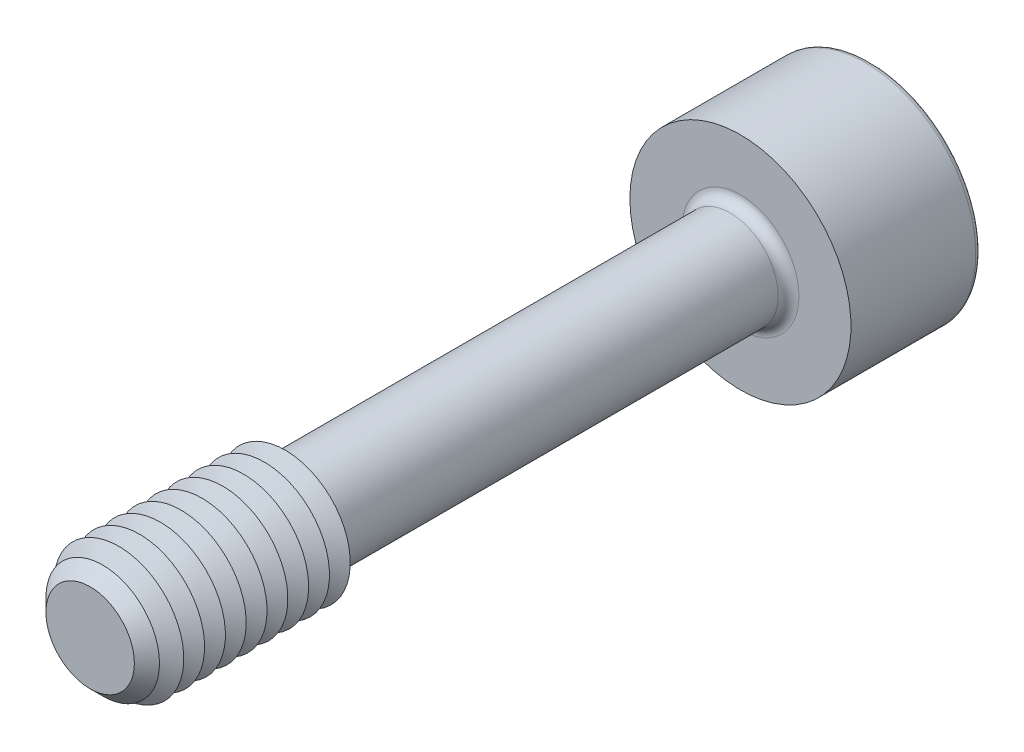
ISO-10303-21;
HEADER;
FILE_DESCRIPTION(('STEP AP214'),'2;1');
FILE_NAME('part.step','',(''),(''),'','','');
FILE_SCHEMA(('AUTOMOTIVE_DESIGN { 1 0 10303 214 1 1 1 1 }'));
ENDSEC;
DATA;
#1=APPLICATION_CONTEXT('core data for automotive mechanical design processes');
#2=APPLICATION_PROTOCOL_DEFINITION('international standard','automotive_design',2000,#1);
#3=PRODUCT_CONTEXT('',#1,'mechanical');
#4=PRODUCT('Part','Part','',(#3));
#5=PRODUCT_RELATED_PRODUCT_CATEGORY('part','',(#4));
#6=PRODUCT_DEFINITION_FORMATION('','',#4);
#7=PRODUCT_DEFINITION_CONTEXT('part definition',#1,'design');
#8=PRODUCT_DEFINITION('design','',#6,#7);
#9=PRODUCT_DEFINITION_SHAPE('','',#8);
#10=(LENGTH_UNIT() NAMED_UNIT(*) SI_UNIT(.MILLI.,.METRE.));
#11=(NAMED_UNIT(*) PLANE_ANGLE_UNIT() SI_UNIT($,.RADIAN.));
#12=(NAMED_UNIT(*) SI_UNIT($,.STERADIAN.) SOLID_ANGLE_UNIT());
#13=UNCERTAINTY_MEASURE_WITH_UNIT(LENGTH_MEASURE(1.E-05),#10,'distance_accuracy_value','');
#14=(GEOMETRIC_REPRESENTATION_CONTEXT(3) GLOBAL_UNCERTAINTY_ASSIGNED_CONTEXT((#13)) GLOBAL_UNIT_ASSIGNED_CONTEXT((#10,
#11,#12)) REPRESENTATION_CONTEXT('',''));
#15=CARTESIAN_POINT('',(0.,0.,0.));
#16=DIRECTION('',(0.,0.,1.));
#17=DIRECTION('',(1.,0.,0.));
#18=AXIS2_PLACEMENT_3D('',#15,#16,#17);
#19=CARTESIAN_POINT('',(-1.15470053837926,-2.,-13.5));
#20=DIRECTION('',(0.,0.,1.));
#21=DIRECTION('',(1.,0.,0.));
#22=AXIS2_PLACEMENT_3D('',#19,#20,#21);
#23=PLANE('',#22);
#24=DIRECTION('',(1.,0.,0.));
#25=VECTOR('',#24,1.);
#26=CARTESIAN_POINT('',(-1.15470053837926,-2.,-13.5));
#27=LINE('',#26,#25);
#28=CARTESIAN_POINT('',(0.,-2.,-13.5));
#29=VERTEX_POINT('',#28);
#30=CARTESIAN_POINT('',(1.15470053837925,-2.,-13.5));
#31=VERTEX_POINT('',#30);
#32=EDGE_CURVE('E795',#29,#31,#27,.T.);
#33=ORIENTED_EDGE('',*,*,#32,.F.);
#34=CARTESIAN_POINT('',(0.,0.,-13.5));
#35=DIRECTION('',(0.,0.,1.));
#36=DIRECTION('',(0.,-1.,0.));
#37=AXIS2_PLACEMENT_3D('',#34,#35,#36);
#38=CIRCLE('',#37,2.);
#39=CARTESIAN_POINT('',(1.73205080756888,-0.999999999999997,-13.5));
#40=VERTEX_POINT('',#39);
#41=EDGE_CURVE('E53',#29,#40,#38,.T.);
#42=ORIENTED_EDGE('',*,*,#41,.T.);
#43=DIRECTION('',(0.5,0.866025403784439,0.));
#44=VECTOR('',#43,1.);
#45=CARTESIAN_POINT('',(1.15470053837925,-2.,-13.5));
#46=LINE('',#45,#44);
#47=EDGE_CURVE('E782',#31,#40,#46,.T.);
#48=ORIENTED_EDGE('',*,*,#47,.F.);
#49=EDGE_LOOP('',(#33,#42,#48));
#50=FACE_BOUND('',#49,.T.);
#51=ADVANCED_FACE('F41',(#50),#23,.F.);
#52=CARTESIAN_POINT('',(2.3094010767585,0.,-13.5));
#53=VERTEX_POINT('',#52);
#54=EDGE_CURVE('E791',#40,#53,#46,.T.);
#55=ORIENTED_EDGE('',*,*,#54,.F.);
#56=CARTESIAN_POINT('',(1.73205080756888,1.,-13.5));
#57=VERTEX_POINT('',#56);
#58=EDGE_CURVE('E11',#40,#57,#38,.T.);
#59=ORIENTED_EDGE('',*,*,#58,.T.);
#60=DIRECTION('',(-0.499999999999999,0.866025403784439,0.));
#61=VECTOR('',#60,1.);
#62=CARTESIAN_POINT('',(2.3094010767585,0.,-13.5));
#63=LINE('',#62,#61);
#64=EDGE_CURVE('E781',#53,#57,#63,.T.);
#65=ORIENTED_EDGE('',*,*,#64,.F.);
#66=EDGE_LOOP('',(#55,#59,#65));
#67=FACE_BOUND('',#66,.T.);
#68=ADVANCED_FACE('F133',(#67),#23,.F.);
#69=CARTESIAN_POINT('',(1.15470053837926,2.,-13.5));
#70=VERTEX_POINT('',#69);
#71=EDGE_CURVE('E776',#57,#70,#63,.T.);
#72=ORIENTED_EDGE('',*,*,#71,.F.);
#73=CARTESIAN_POINT('',(0.,2.00000000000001,-13.5));
#74=VERTEX_POINT('',#73);
#75=EDGE_CURVE('E51',#57,#74,#38,.T.);
#76=ORIENTED_EDGE('',*,*,#75,.T.);
#77=DIRECTION('',(-1.,0.,0.));
#78=VECTOR('',#77,1.);
#79=CARTESIAN_POINT('',(1.15470053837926,2.,-13.5));
#80=LINE('',#79,#78);
#81=EDGE_CURVE('E177',#70,#74,#80,.T.);
#82=ORIENTED_EDGE('',*,*,#81,.F.);
#83=EDGE_LOOP('',(#72,#76,#82));
#84=FACE_BOUND('',#83,.T.);
#85=ADVANCED_FACE('F139',(#84),#23,.F.);
#86=CARTESIAN_POINT('',(-1.15470053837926,2.,-13.5));
#87=VERTEX_POINT('',#86);
#88=EDGE_CURVE('E786',#74,#87,#80,.T.);
#89=ORIENTED_EDGE('',*,*,#88,.F.);
#90=CARTESIAN_POINT('',(-1.73205080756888,1.00000000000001,-13.5));
#91=VERTEX_POINT('',#90);
#92=EDGE_CURVE('E264',#74,#91,#38,.T.);
#93=ORIENTED_EDGE('',*,*,#92,.T.);
#94=DIRECTION('',(-0.5,-0.866025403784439,0.));
#95=VECTOR('',#94,1.);
#96=CARTESIAN_POINT('',(-1.15470053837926,2.,-13.5));
#97=LINE('',#96,#95);
#98=EDGE_CURVE('E176',#87,#91,#97,.T.);
#99=ORIENTED_EDGE('',*,*,#98,.F.);
#100=EDGE_LOOP('',(#89,#93,#99));
#101=FACE_BOUND('',#100,.T.);
#102=ADVANCED_FACE('F157',(#101),#23,.F.);
#103=CARTESIAN_POINT('',(-2.30940107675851,0.,-13.5));
#104=VERTEX_POINT('',#103);
#105=EDGE_CURVE('E170',#91,#104,#97,.T.);
#106=ORIENTED_EDGE('',*,*,#105,.F.);
#107=CARTESIAN_POINT('',(-1.73205080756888,-0.999999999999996,-13.5));
#108=VERTEX_POINT('',#107);
#109=EDGE_CURVE('E172',#91,#108,#38,.T.);
#110=ORIENTED_EDGE('',*,*,#109,.T.);
#111=DIRECTION('',(0.5,-0.866025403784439,0.));
#112=VECTOR('',#111,1.);
#113=CARTESIAN_POINT('',(-2.30940107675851,0.,-13.5));
#114=LINE('',#113,#112);
#115=EDGE_CURVE('E174',#104,#108,#114,.T.);
#116=ORIENTED_EDGE('',*,*,#115,.F.);
#117=EDGE_LOOP('',(#106,#110,#116));
#118=FACE_BOUND('',#117,.T.);
#119=ADVANCED_FACE('F146',(#118),#23,.F.);
#120=CARTESIAN_POINT('',(0.,0.,-17.5));
#121=DIRECTION('',(0.,0.,-1.));
#122=DIRECTION('',(-1.,0.,0.));
#123=AXIS2_PLACEMENT_3D('',#120,#121,#122);
#124=PLANE('',#123);
#125=CARTESIAN_POINT('',(0.,0.,-17.5));
#126=DIRECTION('',(0.,0.,-1.));
#127=DIRECTION('',(-1.,0.,0.));
#128=AXIS2_PLACEMENT_3D('',#125,#126,#127);
#129=CIRCLE('',#128,4.05);
#130=CARTESIAN_POINT('',(-4.05,0.,-17.5));
#131=VERTEX_POINT('',#130);
#132=EDGE_CURVE('E250',#131,#131,#129,.T.);
#133=ORIENTED_EDGE('',*,*,#132,.T.);
#134=EDGE_LOOP('',(#133));
#135=FACE_BOUND('',#134,.T.);
#136=DIRECTION('',(-0.5,-0.866025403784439,0.));
#137=VECTOR('',#136,1.);
#138=CARTESIAN_POINT('',(-1.15470053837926,2.,-17.5));
#139=LINE('',#138,#137);
#140=CARTESIAN_POINT('',(-1.15470053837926,2.,-17.5));
#141=VERTEX_POINT('',#140);
#142=CARTESIAN_POINT('',(-2.30940107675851,0.,-17.5));
#143=VERTEX_POINT('',#142);
#144=EDGE_CURVE('E211',#141,#143,#139,.T.);
#145=ORIENTED_EDGE('',*,*,#144,.T.);
#146=DIRECTION('',(0.5,-0.866025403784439,0.));
#147=VECTOR('',#146,1.);
#148=CARTESIAN_POINT('',(-2.30940107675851,0.,-17.5));
#149=LINE('',#148,#147);
#150=CARTESIAN_POINT('',(-1.15470053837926,-2.,-17.5));
#151=VERTEX_POINT('',#150);
#152=EDGE_CURVE('E67',#143,#151,#149,.T.);
#153=ORIENTED_EDGE('',*,*,#152,.T.);
#154=DIRECTION('',(1.,0.,0.));
#155=VECTOR('',#154,1.);
#156=CARTESIAN_POINT('',(-1.15470053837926,-2.,-17.5));
#157=LINE('',#156,#155);
#158=CARTESIAN_POINT('',(1.15470053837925,-2.,-17.5));
#159=VERTEX_POINT('',#158);
#160=EDGE_CURVE('E196',#151,#159,#157,.T.);
#161=ORIENTED_EDGE('',*,*,#160,.T.);
#162=DIRECTION('',(0.5,0.866025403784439,0.));
#163=VECTOR('',#162,1.);
#164=CARTESIAN_POINT('',(1.15470053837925,-2.,-17.5));
#165=LINE('',#164,#163);
#166=CARTESIAN_POINT('',(2.3094010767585,0.,-17.5));
#167=VERTEX_POINT('',#166);
#168=EDGE_CURVE('E200',#159,#167,#165,.T.);
#169=ORIENTED_EDGE('',*,*,#168,.T.);
#170=DIRECTION('',(-0.499999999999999,0.866025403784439,0.));
#171=VECTOR('',#170,1.);
#172=CARTESIAN_POINT('',(2.3094010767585,0.,-17.5));
#173=LINE('',#172,#171);
#174=CARTESIAN_POINT('',(1.15470053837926,2.,-17.5));
#175=VERTEX_POINT('',#174);
#176=EDGE_CURVE('E204',#167,#175,#173,.T.);
#177=ORIENTED_EDGE('',*,*,#176,.T.);
#178=DIRECTION('',(-1.,0.,0.));
#179=VECTOR('',#178,1.);
#180=CARTESIAN_POINT('',(1.15470053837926,2.,-17.5));
#181=LINE('',#180,#179);
#182=EDGE_CURVE('E208',#175,#141,#181,.T.);
#183=ORIENTED_EDGE('',*,*,#182,.T.);
#184=EDGE_LOOP('',(#145,#153,#161,#169,#177,#183));
#185=FACE_BOUND('',#184,.T.);
#186=ADVANCED_FACE('F156',(#135,#185),#124,.T.);
#187=CARTESIAN_POINT('',(0.,0.,12.5));
#188=DIRECTION('',(0.,0.,-1.));
#189=DIRECTION('',(-1.,0.,0.));
#190=AXIS2_PLACEMENT_3D('',#187,#188,#189);
#191=CYLINDRICAL_SURFACE('',#190,1.85);
#192=CARTESIAN_POINT('',(0.,0.,-12.1));
#193=DIRECTION('',(0.,0.,-1.));
#194=DIRECTION('',(-1.,0.,0.));
#195=AXIS2_PLACEMENT_3D('',#192,#193,#194);
#196=CIRCLE('',#195,1.85);
#197=CARTESIAN_POINT('',(-1.85,0.,-12.1));
#198=VERTEX_POINT('',#197);
#199=EDGE_CURVE('E246',#198,#198,#196,.F.);
#200=ORIENTED_EDGE('',*,*,#199,.T.);
#201=EDGE_LOOP('',(#200));
#202=FACE_BOUND('',#201,.T.);
#203=CARTESIAN_POINT('',(0.,0.,4.62472232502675));
#204=DIRECTION('',(0.,0.,-1.));
#205=DIRECTION('',(0.,1.,0.));
#206=AXIS2_PLACEMENT_3D('',#203,#204,#205);
#207=CIRCLE('',#206,1.85);
#208=CARTESIAN_POINT('',(0.,1.85,4.62472232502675));
#209=VERTEX_POINT('',#208);
#210=EDGE_CURVE('E234',#209,#209,#207,.T.);
#211=ORIENTED_EDGE('',*,*,#210,.T.);
#212=EDGE_LOOP('',(#211));
#213=FACE_BOUND('',#212,.T.);
#214=ADVANCED_FACE('F163',(#202,#213),#191,.T.);
#215=CARTESIAN_POINT('',(0.,0.,4.62472232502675));
#216=DIRECTION('',(0.,0.,1.));
#217=DIRECTION('',(0.,-1.,0.));
#218=AXIS2_PLACEMENT_3D('',#215,#216,#217);
#219=CONICAL_SURFACE('',#218,1.85,1.0471975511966);
#220=CARTESIAN_POINT('',(0.,0.,5.));
#221=DIRECTION('',(0.,0.,-1.));
#222=DIRECTION('',(-1.,0.,0.));
#223=AXIS2_PLACEMENT_3D('',#220,#221,#222);
#224=CIRCLE('',#223,2.5);
#225=CARTESIAN_POINT('',(-2.5,0.,5.));
#226=VERTEX_POINT('',#225);
#227=EDGE_CURVE('E267',#226,#226,#224,.T.);
#228=ORIENTED_EDGE('',*,*,#227,.T.);
#229=EDGE_LOOP('',(#228));
#230=FACE_BOUND('',#229,.T.);
#231=ORIENTED_EDGE('',*,*,#210,.F.);
#232=EDGE_LOOP('',(#231));
#233=FACE_BOUND('',#232,.T.);
#234=ADVANCED_FACE('F537',(#230,#233),#219,.T.);
#235=CARTESIAN_POINT('',(0.,0.,-12.5));
#236=DIRECTION('',(0.,0.,-1.));
#237=DIRECTION('',(-1.,0.,0.));
#238=AXIS2_PLACEMENT_3D('',#235,#236,#237);
#239=PLANE('',#238);
#240=CARTESIAN_POINT('',(0.,0.,-12.5));
#241=DIRECTION('',(0.,0.,-1.));
#242=DIRECTION('',(-1.,0.,0.));
#243=AXIS2_PLACEMENT_3D('',#240,#241,#242);
#244=CIRCLE('',#243,2.25);
#245=CARTESIAN_POINT('',(-2.25,0.,-12.5));
#246=VERTEX_POINT('',#245);
#247=EDGE_CURVE('E242',#246,#246,#244,.T.);
#248=ORIENTED_EDGE('',*,*,#247,.T.);
#249=EDGE_LOOP('',(#248));
#250=FACE_BOUND('',#249,.T.);
#251=CARTESIAN_POINT('',(0.,0.,-12.5));
#252=DIRECTION('',(0.,0.,-1.));
#253=DIRECTION('',(-1.,0.,0.));
#254=AXIS2_PLACEMENT_3D('',#251,#252,#253);
#255=CIRCLE('',#254,4.25);
#256=CARTESIAN_POINT('',(-4.25,0.,-12.5));
#257=VERTEX_POINT('',#256);
#258=EDGE_CURVE('E230',#257,#257,#255,.T.);
#259=ORIENTED_EDGE('',*,*,#258,.F.);
#260=EDGE_LOOP('',(#259));
#261=FACE_BOUND('',#260,.T.);
#262=ADVANCED_FACE('F530',(#250,#261),#239,.F.);
#263=CARTESIAN_POINT('',(0.,0.,-17.5));
#264=DIRECTION('',(0.,0.,1.));
#265=DIRECTION('',(1.,0.,0.));
#266=AXIS2_PLACEMENT_3D('',#263,#264,#265);
#267=CYLINDRICAL_SURFACE('',#266,4.25);
#268=CARTESIAN_POINT('',(0.,0.,-17.3));
#269=DIRECTION('',(0.,0.,-1.));
#270=DIRECTION('',(-1.,0.,0.));
#271=AXIS2_PLACEMENT_3D('',#268,#269,#270);
#272=CIRCLE('',#271,4.25);
#273=CARTESIAN_POINT('',(-4.25,0.,-17.3));
#274=VERTEX_POINT('',#273);
#275=EDGE_CURVE('E253',#274,#274,#272,.F.);
#276=ORIENTED_EDGE('',*,*,#275,.T.);
#277=EDGE_LOOP('',(#276));
#278=FACE_BOUND('',#277,.T.);
#279=ORIENTED_EDGE('',*,*,#258,.T.);
#280=EDGE_LOOP('',(#279));
#281=FACE_BOUND('',#280,.T.);
#282=ADVANCED_FACE('F536',(#278,#281),#267,.T.);
#283=CARTESIAN_POINT('',(-2.30940107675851,0.,-13.5));
#284=DIRECTION('',(0.866025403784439,0.5,0.));
#285=DIRECTION('',(-0.5,0.866025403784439,0.));
#286=AXIS2_PLACEMENT_3D('',#283,#284,#285);
#287=PLANE('',#286);
#288=ORIENTED_EDGE('',*,*,#152,.F.);
#289=DIRECTION('',(0.,0.,-1.));
#290=VECTOR('',#289,1.);
#291=CARTESIAN_POINT('',(-2.30940107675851,0.,-13.5));
#292=LINE('',#291,#290);
#293=EDGE_CURVE('E186',#104,#143,#292,.T.);
#294=ORIENTED_EDGE('',*,*,#293,.F.);
#295=ORIENTED_EDGE('',*,*,#115,.T.);
#296=CARTESIAN_POINT('',(-1.15470053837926,-2.,-13.5));
#297=VERTEX_POINT('',#296);
#298=EDGE_CURVE('E214',#108,#297,#114,.T.);
#299=ORIENTED_EDGE('',*,*,#298,.T.);
#300=DIRECTION('',(0.,0.,-1.));
#301=VECTOR('',#300,1.);
#302=CARTESIAN_POINT('',(-1.15470053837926,-2.,-13.5));
#303=LINE('',#302,#301);
#304=EDGE_CURVE('E227',#297,#151,#303,.T.);
#305=ORIENTED_EDGE('',*,*,#304,.T.);
#306=EDGE_LOOP('',(#288,#294,#295,#299,#305));
#307=FACE_BOUND('',#306,.T.);
#308=ADVANCED_FACE('F548',(#307),#287,.T.);
#309=CARTESIAN_POINT('',(-1.15470053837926,-2.,-13.5));
#310=DIRECTION('',(0.,1.,0.));
#311=DIRECTION('',(-1.,0.,0.));
#312=AXIS2_PLACEMENT_3D('',#309,#310,#311);
#313=PLANE('',#312);
#314=ORIENTED_EDGE('',*,*,#160,.F.);
#315=ORIENTED_EDGE('',*,*,#304,.F.);
#316=EDGE_CURVE('E792',#297,#29,#27,.T.);
#317=ORIENTED_EDGE('',*,*,#316,.T.);
#318=ORIENTED_EDGE('',*,*,#32,.T.);
#319=DIRECTION('',(0.,0.,-1.));
#320=VECTOR('',#319,1.);
#321=CARTESIAN_POINT('',(1.15470053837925,-2.,-13.5));
#322=LINE('',#321,#320);
#323=EDGE_CURVE('E224',#31,#159,#322,.T.);
#324=ORIENTED_EDGE('',*,*,#323,.T.);
#325=EDGE_LOOP('',(#314,#315,#317,#318,#324));
#326=FACE_BOUND('',#325,.T.);
#327=ADVANCED_FACE('F564',(#326),#313,.T.);
#328=CARTESIAN_POINT('',(1.15470053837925,-2.,-13.5));
#329=DIRECTION('',(-0.866025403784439,0.5,0.));
#330=DIRECTION('',(-0.5,-0.866025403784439,0.));
#331=AXIS2_PLACEMENT_3D('',#328,#329,#330);
#332=PLANE('',#331);
#333=ORIENTED_EDGE('',*,*,#168,.F.);
#334=ORIENTED_EDGE('',*,*,#323,.F.);
#335=ORIENTED_EDGE('',*,*,#47,.T.);
#336=ORIENTED_EDGE('',*,*,#54,.T.);
#337=DIRECTION('',(0.,0.,-1.));
#338=VECTOR('',#337,1.);
#339=CARTESIAN_POINT('',(2.3094010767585,0.,-13.5));
#340=LINE('',#339,#338);
#341=EDGE_CURVE('E221',#53,#167,#340,.T.);
#342=ORIENTED_EDGE('',*,*,#341,.T.);
#343=EDGE_LOOP('',(#333,#334,#335,#336,#342));
#344=FACE_BOUND('',#343,.T.);
#345=ADVANCED_FACE('F574',(#344),#332,.T.);
#346=CARTESIAN_POINT('',(2.3094010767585,0.,-13.5));
#347=DIRECTION('',(-0.866025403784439,-0.499999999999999,0.));
#348=DIRECTION('',(0.499999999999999,-0.866025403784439,0.));
#349=AXIS2_PLACEMENT_3D('',#346,#347,#348);
#350=PLANE('',#349);
#351=ORIENTED_EDGE('',*,*,#176,.F.);
#352=ORIENTED_EDGE('',*,*,#341,.F.);
#353=ORIENTED_EDGE('',*,*,#64,.T.);
#354=ORIENTED_EDGE('',*,*,#71,.T.);
#355=DIRECTION('',(0.,0.,-1.));
#356=VECTOR('',#355,1.);
#357=CARTESIAN_POINT('',(1.15470053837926,2.,-13.5));
#358=LINE('',#357,#356);
#359=EDGE_CURVE('E218',#70,#175,#358,.T.);
#360=ORIENTED_EDGE('',*,*,#359,.T.);
#361=EDGE_LOOP('',(#351,#352,#353,#354,#360));
#362=FACE_BOUND('',#361,.T.);
#363=ADVANCED_FACE('F584',(#362),#350,.T.);
#364=CARTESIAN_POINT('',(1.15470053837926,2.,-13.5));
#365=DIRECTION('',(0.,-1.,0.));
#366=DIRECTION('',(0.,0.,-1.));
#367=AXIS2_PLACEMENT_3D('',#364,#365,#366);
#368=PLANE('',#367);
#369=ORIENTED_EDGE('',*,*,#182,.F.);
#370=ORIENTED_EDGE('',*,*,#359,.F.);
#371=ORIENTED_EDGE('',*,*,#81,.T.);
#372=ORIENTED_EDGE('',*,*,#88,.T.);
#373=DIRECTION('',(0.,0.,-1.));
#374=VECTOR('',#373,1.);
#375=CARTESIAN_POINT('',(-1.15470053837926,2.,-13.5));
#376=LINE('',#375,#374);
#377=EDGE_CURVE('E182',#87,#141,#376,.T.);
#378=ORIENTED_EDGE('',*,*,#377,.T.);
#379=EDGE_LOOP('',(#369,#370,#371,#372,#378));
#380=FACE_BOUND('',#379,.T.);
#381=ADVANCED_FACE('F152',(#380),#368,.T.);
#382=CARTESIAN_POINT('',(-1.15470053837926,2.,-13.5));
#383=DIRECTION('',(0.866025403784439,-0.5,0.));
#384=DIRECTION('',(0.5,0.866025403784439,0.));
#385=AXIS2_PLACEMENT_3D('',#382,#383,#384);
#386=PLANE('',#385);
#387=ORIENTED_EDGE('',*,*,#144,.F.);
#388=ORIENTED_EDGE('',*,*,#377,.F.);
#389=ORIENTED_EDGE('',*,*,#98,.T.);
#390=ORIENTED_EDGE('',*,*,#105,.T.);
#391=ORIENTED_EDGE('',*,*,#293,.T.);
#392=EDGE_LOOP('',(#387,#388,#389,#390,#391));
#393=FACE_BOUND('',#392,.T.);
#394=ADVANCED_FACE('F144',(#393),#386,.T.);
#395=ORIENTED_EDGE('',*,*,#298,.F.);
#396=EDGE_CURVE('E256',#108,#29,#38,.T.);
#397=ORIENTED_EDGE('',*,*,#396,.T.);
#398=ORIENTED_EDGE('',*,*,#316,.F.);
#399=EDGE_LOOP('',(#395,#397,#398));
#400=FACE_BOUND('',#399,.T.);
#401=ADVANCED_FACE('F135',(#400),#23,.F.);
#402=CARTESIAN_POINT('',(0.,0.,-12.1));
#403=DIRECTION('',(0.,0.,-1.));
#404=DIRECTION('',(-1.,0.,0.));
#405=AXIS2_PLACEMENT_3D('',#402,#403,#404);
#406=TOROIDAL_SURFACE('',#405,2.25,0.4);
#407=ORIENTED_EDGE('',*,*,#199,.F.);
#408=EDGE_LOOP('',(#407));
#409=FACE_BOUND('',#408,.T.);
#410=ORIENTED_EDGE('',*,*,#247,.F.);
#411=EDGE_LOOP('',(#410));
#412=FACE_BOUND('',#411,.T.);
#413=ADVANCED_FACE('F129',(#409,#412),#406,.F.);
#414=CARTESIAN_POINT('',(0.,0.,-17.3));
#415=DIRECTION('',(0.,0.,-1.));
#416=DIRECTION('',(-1.,0.,0.));
#417=AXIS2_PLACEMENT_3D('',#414,#415,#416);
#418=TOROIDAL_SURFACE('',#417,4.05,0.2);
#419=ORIENTED_EDGE('',*,*,#275,.F.);
#420=EDGE_LOOP('',(#419));
#421=FACE_BOUND('',#420,.T.);
#422=ORIENTED_EDGE('',*,*,#132,.F.);
#423=EDGE_LOOP('',(#422));
#424=FACE_BOUND('',#423,.T.);
#425=ADVANCED_FACE('F43',(#421,#424),#418,.T.);
#426=CARTESIAN_POINT('',(0.,0.,-12.3452994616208));
#427=DIRECTION('',(0.,0.,-1.));
#428=DIRECTION('',(0.,1.,0.));
#429=AXIS2_PLACEMENT_3D('',#426,#427,#428);
#430=CONICAL_SURFACE('',#429,0.,1.04719755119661);
#431=ORIENTED_EDGE('',*,*,#41,.F.);
#432=ORIENTED_EDGE('',*,*,#396,.F.);
#433=ORIENTED_EDGE('',*,*,#109,.F.);
#434=ORIENTED_EDGE('',*,*,#92,.F.);
#435=ORIENTED_EDGE('',*,*,#75,.F.);
#436=ORIENTED_EDGE('',*,*,#58,.F.);
#437=EDGE_LOOP('',(#431,#432,#433,#434,#435,#436));
#438=FACE_BOUND('',#437,.T.);
#439=CARTESIAN_POINT('',(0.,0.,-12.3452994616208));
#440=VERTEX_POINT('',#439);
#441=VERTEX_LOOP('',#440);
#442=FACE_BOUND('',#441,.T.);
#443=ADVANCED_FACE('F118',(#438,#442),#430,.F.);
#444=CARTESIAN_POINT('',(0.,0.,5.4));
#445=DIRECTION('',(0.,0.,-1.));
#446=DIRECTION('',(-1.,0.,0.));
#447=AXIS2_PLACEMENT_3D('',#444,#445,#446);
#448=CONICAL_SURFACE('',#447,1.80717967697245,1.0471975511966);
#449=ORIENTED_EDGE('',*,*,#227,.F.);
#450=EDGE_LOOP('',(#449));
#451=FACE_BOUND('',#450,.T.);
#452=CARTESIAN_POINT('',(0.,0.,5.4));
#453=DIRECTION('',(0.,0.,-1.));
#454=DIRECTION('',(-1.,0.,0.));
#455=AXIS2_PLACEMENT_3D('',#452,#453,#454);
#456=CIRCLE('',#455,1.80717967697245);
#457=CARTESIAN_POINT('',(-1.80717967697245,0.,5.4));
#458=VERTEX_POINT('',#457);
#459=EDGE_CURVE('E273',#458,#458,#456,.T.);
#460=ORIENTED_EDGE('',*,*,#459,.T.);
#461=EDGE_LOOP('',(#460));
#462=FACE_BOUND('',#461,.T.);
#463=ADVANCED_FACE('F120',(#451,#462),#448,.T.);
#464=CARTESIAN_POINT('',(0.,0.,5.8));
#465=DIRECTION('',(0.,0.,1.));
#466=DIRECTION('',(1.,0.,0.));
#467=AXIS2_PLACEMENT_3D('',#464,#465,#466);
#468=CONICAL_SURFACE('',#467,2.5,1.0471975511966);
#469=ORIENTED_EDGE('',*,*,#459,.F.);
#470=EDGE_LOOP('',(#469));
#471=FACE_BOUND('',#470,.T.);
#472=CARTESIAN_POINT('',(0.,0.,5.8));
#473=DIRECTION('',(0.,0.,-1.));
#474=DIRECTION('',(-1.,0.,0.));
#475=AXIS2_PLACEMENT_3D('',#472,#473,#474);
#476=CIRCLE('',#475,2.5);
#477=CARTESIAN_POINT('',(-2.5,0.,5.8));
#478=VERTEX_POINT('',#477);
#479=EDGE_CURVE('E279',#478,#478,#476,.T.);
#480=ORIENTED_EDGE('',*,*,#479,.T.);
#481=EDGE_LOOP('',(#480));
#482=FACE_BOUND('',#481,.T.);
#483=ADVANCED_FACE('F126',(#471,#482),#468,.T.);
#484=CARTESIAN_POINT('',(0.,0.,6.2));
#485=DIRECTION('',(0.,0.,-1.));
#486=DIRECTION('',(-1.,0.,0.));
#487=AXIS2_PLACEMENT_3D('',#484,#485,#486);
#488=CONICAL_SURFACE('',#487,1.80717967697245,1.0471975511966);
#489=ORIENTED_EDGE('',*,*,#479,.F.);
#490=EDGE_LOOP('',(#489));
#491=FACE_BOUND('',#490,.T.);
#492=CARTESIAN_POINT('',(0.,0.,6.2));
#493=DIRECTION('',(0.,0.,-1.));
#494=DIRECTION('',(-1.,0.,0.));
#495=AXIS2_PLACEMENT_3D('',#492,#493,#494);
#496=CIRCLE('',#495,1.80717967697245);
#497=CARTESIAN_POINT('',(-1.80717967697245,0.,6.2));
#498=VERTEX_POINT('',#497);
#499=EDGE_CURVE('E285',#498,#498,#496,.T.);
#500=ORIENTED_EDGE('',*,*,#499,.T.);
#501=EDGE_LOOP('',(#500));
#502=FACE_BOUND('',#501,.T.);
#503=ADVANCED_FACE('F414',(#491,#502),#488,.T.);
#504=CARTESIAN_POINT('',(0.,0.,6.6));
#505=DIRECTION('',(0.,0.,1.));
#506=DIRECTION('',(1.,0.,0.));
#507=AXIS2_PLACEMENT_3D('',#504,#505,#506);
#508=CONICAL_SURFACE('',#507,2.5,1.0471975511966);
#509=ORIENTED_EDGE('',*,*,#499,.F.);
#510=EDGE_LOOP('',(#509));
#511=FACE_BOUND('',#510,.T.);
#512=CARTESIAN_POINT('',(0.,0.,6.6));
#513=DIRECTION('',(0.,0.,-1.));
#514=DIRECTION('',(-1.,0.,0.));
#515=AXIS2_PLACEMENT_3D('',#512,#513,#514);
#516=CIRCLE('',#515,2.5);
#517=CARTESIAN_POINT('',(-2.5,0.,6.6));
#518=VERTEX_POINT('',#517);
#519=EDGE_CURVE('E289',#518,#518,#516,.T.);
#520=ORIENTED_EDGE('',*,*,#519,.T.);
#521=EDGE_LOOP('',(#520));
#522=FACE_BOUND('',#521,.T.);
#523=ADVANCED_FACE('F410',(#511,#522),#508,.T.);
#524=CARTESIAN_POINT('',(0.,0.,7.));
#525=DIRECTION('',(0.,0.,-1.));
#526=DIRECTION('',(-1.,0.,0.));
#527=AXIS2_PLACEMENT_3D('',#524,#525,#526);
#528=CONICAL_SURFACE('',#527,1.80717967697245,1.0471975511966);
#529=ORIENTED_EDGE('',*,*,#519,.F.);
#530=EDGE_LOOP('',(#529));
#531=FACE_BOUND('',#530,.T.);
#532=CARTESIAN_POINT('',(0.,0.,7.));
#533=DIRECTION('',(0.,0.,-1.));
#534=DIRECTION('',(-1.,0.,0.));
#535=AXIS2_PLACEMENT_3D('',#532,#533,#534);
#536=CIRCLE('',#535,1.80717967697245);
#537=CARTESIAN_POINT('',(-1.80717967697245,0.,7.));
#538=VERTEX_POINT('',#537);
#539=EDGE_CURVE('E293',#538,#538,#536,.T.);
#540=ORIENTED_EDGE('',*,*,#539,.T.);
#541=EDGE_LOOP('',(#540));
#542=FACE_BOUND('',#541,.T.);
#543=ADVANCED_FACE('F406',(#531,#542),#528,.T.);
#544=CARTESIAN_POINT('',(0.,0.,7.4));
#545=DIRECTION('',(0.,0.,1.));
#546=DIRECTION('',(1.,0.,0.));
#547=AXIS2_PLACEMENT_3D('',#544,#545,#546);
#548=CONICAL_SURFACE('',#547,2.5,1.0471975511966);
#549=ORIENTED_EDGE('',*,*,#539,.F.);
#550=EDGE_LOOP('',(#549));
#551=FACE_BOUND('',#550,.T.);
#552=CARTESIAN_POINT('',(0.,0.,7.4));
#553=DIRECTION('',(0.,0.,-1.));
#554=DIRECTION('',(-1.,0.,0.));
#555=AXIS2_PLACEMENT_3D('',#552,#553,#554);
#556=CIRCLE('',#555,2.5);
#557=CARTESIAN_POINT('',(-2.5,0.,7.4));
#558=VERTEX_POINT('',#557);
#559=EDGE_CURVE('E297',#558,#558,#556,.T.);
#560=ORIENTED_EDGE('',*,*,#559,.T.);
#561=EDGE_LOOP('',(#560));
#562=FACE_BOUND('',#561,.T.);
#563=ADVANCED_FACE('F402',(#551,#562),#548,.T.);
#564=CARTESIAN_POINT('',(0.,0.,7.8));
#565=DIRECTION('',(0.,0.,-1.));
#566=DIRECTION('',(-1.,0.,0.));
#567=AXIS2_PLACEMENT_3D('',#564,#565,#566);
#568=CONICAL_SURFACE('',#567,1.80717967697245,1.0471975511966);
#569=ORIENTED_EDGE('',*,*,#559,.F.);
#570=EDGE_LOOP('',(#569));
#571=FACE_BOUND('',#570,.T.);
#572=CARTESIAN_POINT('',(0.,0.,7.8));
#573=DIRECTION('',(0.,0.,-1.));
#574=DIRECTION('',(-1.,0.,0.));
#575=AXIS2_PLACEMENT_3D('',#572,#573,#574);
#576=CIRCLE('',#575,1.80717967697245);
#577=CARTESIAN_POINT('',(-1.80717967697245,0.,7.8));
#578=VERTEX_POINT('',#577);
#579=EDGE_CURVE('E301',#578,#578,#576,.T.);
#580=ORIENTED_EDGE('',*,*,#579,.T.);
#581=EDGE_LOOP('',(#580));
#582=FACE_BOUND('',#581,.T.);
#583=ADVANCED_FACE('F398',(#571,#582),#568,.T.);
#584=CARTESIAN_POINT('',(0.,0.,8.2));
#585=DIRECTION('',(0.,0.,1.));
#586=DIRECTION('',(1.,0.,0.));
#587=AXIS2_PLACEMENT_3D('',#584,#585,#586);
#588=CONICAL_SURFACE('',#587,2.5,1.0471975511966);
#589=ORIENTED_EDGE('',*,*,#579,.F.);
#590=EDGE_LOOP('',(#589));
#591=FACE_BOUND('',#590,.T.);
#592=CARTESIAN_POINT('',(0.,0.,8.2));
#593=DIRECTION('',(0.,0.,-1.));
#594=DIRECTION('',(-1.,0.,0.));
#595=AXIS2_PLACEMENT_3D('',#592,#593,#594);
#596=CIRCLE('',#595,2.5);
#597=CARTESIAN_POINT('',(-2.5,0.,8.2));
#598=VERTEX_POINT('',#597);
#599=EDGE_CURVE('E305',#598,#598,#596,.T.);
#600=ORIENTED_EDGE('',*,*,#599,.T.);
#601=EDGE_LOOP('',(#600));
#602=FACE_BOUND('',#601,.T.);
#603=ADVANCED_FACE('F394',(#591,#602),#588,.T.);
#604=CARTESIAN_POINT('',(0.,0.,8.6));
#605=DIRECTION('',(0.,0.,-1.));
#606=DIRECTION('',(-1.,0.,0.));
#607=AXIS2_PLACEMENT_3D('',#604,#605,#606);
#608=CONICAL_SURFACE('',#607,1.80717967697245,1.0471975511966);
#609=ORIENTED_EDGE('',*,*,#599,.F.);
#610=EDGE_LOOP('',(#609));
#611=FACE_BOUND('',#610,.T.);
#612=CARTESIAN_POINT('',(0.,0.,8.6));
#613=DIRECTION('',(0.,0.,-1.));
#614=DIRECTION('',(-1.,0.,0.));
#615=AXIS2_PLACEMENT_3D('',#612,#613,#614);
#616=CIRCLE('',#615,1.80717967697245);
#617=CARTESIAN_POINT('',(-1.80717967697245,0.,8.6));
#618=VERTEX_POINT('',#617);
#619=EDGE_CURVE('E309',#618,#618,#616,.T.);
#620=ORIENTED_EDGE('',*,*,#619,.T.);
#621=EDGE_LOOP('',(#620));
#622=FACE_BOUND('',#621,.T.);
#623=ADVANCED_FACE('F390',(#611,#622),#608,.T.);
#624=CARTESIAN_POINT('',(0.,0.,9.));
#625=DIRECTION('',(0.,0.,1.));
#626=DIRECTION('',(1.,0.,0.));
#627=AXIS2_PLACEMENT_3D('',#624,#625,#626);
#628=CONICAL_SURFACE('',#627,2.5,1.0471975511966);
#629=ORIENTED_EDGE('',*,*,#619,.F.);
#630=EDGE_LOOP('',(#629));
#631=FACE_BOUND('',#630,.T.);
#632=CARTESIAN_POINT('',(0.,0.,9.));
#633=DIRECTION('',(0.,0.,-1.));
#634=DIRECTION('',(-1.,0.,0.));
#635=AXIS2_PLACEMENT_3D('',#632,#633,#634);
#636=CIRCLE('',#635,2.5);
#637=CARTESIAN_POINT('',(-2.5,0.,9.));
#638=VERTEX_POINT('',#637);
#639=EDGE_CURVE('E313',#638,#638,#636,.T.);
#640=ORIENTED_EDGE('',*,*,#639,.T.);
#641=EDGE_LOOP('',(#640));
#642=FACE_BOUND('',#641,.T.);
#643=ADVANCED_FACE('F386',(#631,#642),#628,.T.);
#644=CARTESIAN_POINT('',(0.,0.,9.4));
#645=DIRECTION('',(0.,0.,-1.));
#646=DIRECTION('',(-1.,0.,0.));
#647=AXIS2_PLACEMENT_3D('',#644,#645,#646);
#648=CONICAL_SURFACE('',#647,1.80717967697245,1.0471975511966);
#649=ORIENTED_EDGE('',*,*,#639,.F.);
#650=EDGE_LOOP('',(#649));
#651=FACE_BOUND('',#650,.T.);
#652=CARTESIAN_POINT('',(0.,0.,9.4));
#653=DIRECTION('',(0.,0.,-1.));
#654=DIRECTION('',(-1.,0.,0.));
#655=AXIS2_PLACEMENT_3D('',#652,#653,#654);
#656=CIRCLE('',#655,1.80717967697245);
#657=CARTESIAN_POINT('',(-1.80717967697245,0.,9.4));
#658=VERTEX_POINT('',#657);
#659=EDGE_CURVE('E317',#658,#658,#656,.T.);
#660=ORIENTED_EDGE('',*,*,#659,.T.);
#661=EDGE_LOOP('',(#660));
#662=FACE_BOUND('',#661,.T.);
#663=ADVANCED_FACE('F382',(#651,#662),#648,.T.);
#664=CARTESIAN_POINT('',(0.,0.,9.8));
#665=DIRECTION('',(0.,0.,1.));
#666=DIRECTION('',(1.,0.,0.));
#667=AXIS2_PLACEMENT_3D('',#664,#665,#666);
#668=CONICAL_SURFACE('',#667,2.5,1.0471975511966);
#669=ORIENTED_EDGE('',*,*,#659,.F.);
#670=EDGE_LOOP('',(#669));
#671=FACE_BOUND('',#670,.T.);
#672=CARTESIAN_POINT('',(0.,0.,9.8));
#673=DIRECTION('',(0.,0.,-1.));
#674=DIRECTION('',(-1.,0.,0.));
#675=AXIS2_PLACEMENT_3D('',#672,#673,#674);
#676=CIRCLE('',#675,2.5);
#677=CARTESIAN_POINT('',(-2.5,0.,9.8));
#678=VERTEX_POINT('',#677);
#679=EDGE_CURVE('E321',#678,#678,#676,.T.);
#680=ORIENTED_EDGE('',*,*,#679,.T.);
#681=EDGE_LOOP('',(#680));
#682=FACE_BOUND('',#681,.T.);
#683=ADVANCED_FACE('F378',(#671,#682),#668,.T.);
#684=CARTESIAN_POINT('',(0.,0.,10.2));
#685=DIRECTION('',(0.,0.,-1.));
#686=DIRECTION('',(-1.,0.,0.));
#687=AXIS2_PLACEMENT_3D('',#684,#685,#686);
#688=CONICAL_SURFACE('',#687,1.80717967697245,1.0471975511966);
#689=ORIENTED_EDGE('',*,*,#679,.F.);
#690=EDGE_LOOP('',(#689));
#691=FACE_BOUND('',#690,.T.);
#692=CARTESIAN_POINT('',(0.,0.,10.2));
#693=DIRECTION('',(0.,0.,-1.));
#694=DIRECTION('',(-1.,0.,0.));
#695=AXIS2_PLACEMENT_3D('',#692,#693,#694);
#696=CIRCLE('',#695,1.80717967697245);
#697=CARTESIAN_POINT('',(-1.80717967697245,0.,10.2));
#698=VERTEX_POINT('',#697);
#699=EDGE_CURVE('E325',#698,#698,#696,.T.);
#700=ORIENTED_EDGE('',*,*,#699,.T.);
#701=EDGE_LOOP('',(#700));
#702=FACE_BOUND('',#701,.T.);
#703=ADVANCED_FACE('F374',(#691,#702),#688,.T.);
#704=CARTESIAN_POINT('',(0.,0.,10.6));
#705=DIRECTION('',(0.,0.,1.));
#706=DIRECTION('',(1.,0.,0.));
#707=AXIS2_PLACEMENT_3D('',#704,#705,#706);
#708=CONICAL_SURFACE('',#707,2.5,1.0471975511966);
#709=ORIENTED_EDGE('',*,*,#699,.F.);
#710=EDGE_LOOP('',(#709));
#711=FACE_BOUND('',#710,.T.);
#712=CARTESIAN_POINT('',(0.,0.,10.6));
#713=DIRECTION('',(0.,0.,-1.));
#714=DIRECTION('',(-1.,0.,0.));
#715=AXIS2_PLACEMENT_3D('',#712,#713,#714);
#716=CIRCLE('',#715,2.5);
#717=CARTESIAN_POINT('',(-2.5,0.,10.6));
#718=VERTEX_POINT('',#717);
#719=EDGE_CURVE('E329',#718,#718,#716,.T.);
#720=ORIENTED_EDGE('',*,*,#719,.T.);
#721=EDGE_LOOP('',(#720));
#722=FACE_BOUND('',#721,.T.);
#723=ADVANCED_FACE('F370',(#711,#722),#708,.T.);
#724=CARTESIAN_POINT('',(0.,0.,11.));
#725=DIRECTION('',(0.,0.,-1.));
#726=DIRECTION('',(-1.,0.,0.));
#727=AXIS2_PLACEMENT_3D('',#724,#725,#726);
#728=CONICAL_SURFACE('',#727,1.80717967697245,1.0471975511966);
#729=ORIENTED_EDGE('',*,*,#719,.F.);
#730=EDGE_LOOP('',(#729));
#731=FACE_BOUND('',#730,.T.);
#732=CARTESIAN_POINT('',(0.,0.,11.));
#733=DIRECTION('',(0.,0.,-1.));
#734=DIRECTION('',(-1.,0.,0.));
#735=AXIS2_PLACEMENT_3D('',#732,#733,#734);
#736=CIRCLE('',#735,1.80717967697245);
#737=CARTESIAN_POINT('',(-1.80717967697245,0.,11.));
#738=VERTEX_POINT('',#737);
#739=EDGE_CURVE('E333',#738,#738,#736,.T.);
#740=ORIENTED_EDGE('',*,*,#739,.T.);
#741=EDGE_LOOP('',(#740));
#742=FACE_BOUND('',#741,.T.);
#743=ADVANCED_FACE('F366',(#731,#742),#728,.T.);
#744=CARTESIAN_POINT('',(0.,0.,11.4));
#745=DIRECTION('',(0.,0.,1.));
#746=DIRECTION('',(1.,0.,0.));
#747=AXIS2_PLACEMENT_3D('',#744,#745,#746);
#748=CONICAL_SURFACE('',#747,2.5,1.0471975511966);
#749=ORIENTED_EDGE('',*,*,#739,.F.);
#750=EDGE_LOOP('',(#749));
#751=FACE_BOUND('',#750,.T.);
#752=CARTESIAN_POINT('',(0.,0.,11.4));
#753=DIRECTION('',(0.,0.,-1.));
#754=DIRECTION('',(-1.,0.,0.));
#755=AXIS2_PLACEMENT_3D('',#752,#753,#754);
#756=CIRCLE('',#755,2.5);
#757=CARTESIAN_POINT('',(-2.5,0.,11.4));
#758=VERTEX_POINT('',#757);
#759=EDGE_CURVE('E337',#758,#758,#756,.T.);
#760=ORIENTED_EDGE('',*,*,#759,.T.);
#761=EDGE_LOOP('',(#760));
#762=FACE_BOUND('',#761,.T.);
#763=ADVANCED_FACE('F359',(#751,#762),#748,.T.);
#764=CARTESIAN_POINT('',(0.,0.,11.8));
#765=DIRECTION('',(0.,0.,-1.));
#766=DIRECTION('',(-1.,0.,0.));
#767=AXIS2_PLACEMENT_3D('',#764,#765,#766);
#768=CONICAL_SURFACE('',#767,1.80717967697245,1.0471975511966);
#769=ORIENTED_EDGE('',*,*,#759,.F.);
#770=EDGE_LOOP('',(#769));
#771=FACE_BOUND('',#770,.T.);
#772=CARTESIAN_POINT('',(0.,0.,11.8));
#773=DIRECTION('',(0.,0.,-1.));
#774=DIRECTION('',(-1.,0.,0.));
#775=AXIS2_PLACEMENT_3D('',#772,#773,#774);
#776=CIRCLE('',#775,1.80717967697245);
#777=CARTESIAN_POINT('',(-1.80717967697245,0.,11.8));
#778=VERTEX_POINT('',#777);
#779=EDGE_CURVE('E341',#778,#778,#776,.T.);
#780=ORIENTED_EDGE('',*,*,#779,.T.);
#781=EDGE_LOOP('',(#780));
#782=FACE_BOUND('',#781,.T.);
#783=ADVANCED_FACE('F345',(#771,#782),#768,.T.);
#784=CARTESIAN_POINT('',(0.,0.,12.2));
#785=DIRECTION('',(0.,0.,1.));
#786=DIRECTION('',(1.,0.,0.));
#787=AXIS2_PLACEMENT_3D('',#784,#785,#786);
#788=CONICAL_SURFACE('',#787,2.5,1.0471975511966);
#789=CARTESIAN_POINT('',(0.,0.,12.0169872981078));
#790=DIRECTION('',(0.,0.,1.));
#791=DIRECTION('',(1.,0.,0.));
#792=AXIS2_PLACEMENT_3D('',#789,#790,#791);
#793=CIRCLE('',#792,2.18301270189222);
#794=CARTESIAN_POINT('',(2.18301270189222,0.,12.0169872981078));
#795=VERTEX_POINT('',#794);
#796=EDGE_CURVE('E45',#795,#795,#793,.F.);
#797=ORIENTED_EDGE('',*,*,#796,.T.);
#798=EDGE_LOOP('',(#797));
#799=FACE_BOUND('',#798,.T.);
#800=ORIENTED_EDGE('',*,*,#779,.F.);
#801=EDGE_LOOP('',(#800));
#802=FACE_BOUND('',#801,.T.);
#803=ADVANCED_FACE('F347',(#799,#802),#788,.T.);
#804=CARTESIAN_POINT('',(0.,0.,12.5));
#805=DIRECTION('',(0.,0.,1.));
#806=DIRECTION('',(1.,0.,0.));
#807=AXIS2_PLACEMENT_3D('',#804,#805,#806);
#808=PLANE('',#807);
#809=CARTESIAN_POINT('',(0.,0.,12.5));
#810=DIRECTION('',(0.,0.,1.));
#811=DIRECTION('',(1.,0.,0.));
#812=AXIS2_PLACEMENT_3D('',#809,#810,#811);
#813=CIRCLE('',#812,1.7);
#814=CARTESIAN_POINT('',(1.7,0.,12.5));
#815=VERTEX_POINT('',#814);
#816=EDGE_CURVE('E238',#815,#815,#813,.T.);
#817=ORIENTED_EDGE('',*,*,#816,.T.);
#818=EDGE_LOOP('',(#817));
#819=FACE_BOUND('',#818,.T.);
#820=ADVANCED_FACE('F349',(#819),#808,.T.);
#821=CARTESIAN_POINT('',(0.,0.,11.7));
#822=DIRECTION('',(0.,0.,-1.));
#823=DIRECTION('',(0.,1.,0.));
#824=AXIS2_PLACEMENT_3D('',#821,#822,#823);
#825=CONICAL_SURFACE('',#824,2.5,0.785398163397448);
#826=ORIENTED_EDGE('',*,*,#796,.F.);
#827=EDGE_LOOP('',(#826));
#828=FACE_BOUND('',#827,.T.);
#829=ORIENTED_EDGE('',*,*,#816,.F.);
#830=EDGE_LOOP('',(#829));
#831=FACE_BOUND('',#830,.T.);
#832=ADVANCED_FACE('F356',(#828,#831),#825,.T.);
#833=CLOSED_SHELL('',(#51,#68,#85,#102,#119,#186,#214,#234,#262,#282,#308,#327,#345,#363,#381,
#394,#401,#413,#425,#443,#463,#483,#503,#523,#543,#563,#583,#603,#623,#643,#663,#683,#703,#723,
#743,#763,#783,#803,#820,#832));
#834=MANIFOLD_SOLID_BREP('B2',#833);
#835=ADVANCED_BREP_SHAPE_REPRESENTATION('',(#18,#834),#14);
#836=SHAPE_DEFINITION_REPRESENTATION(#9,#835);
ENDSEC;
END-ISO-10303-21;
